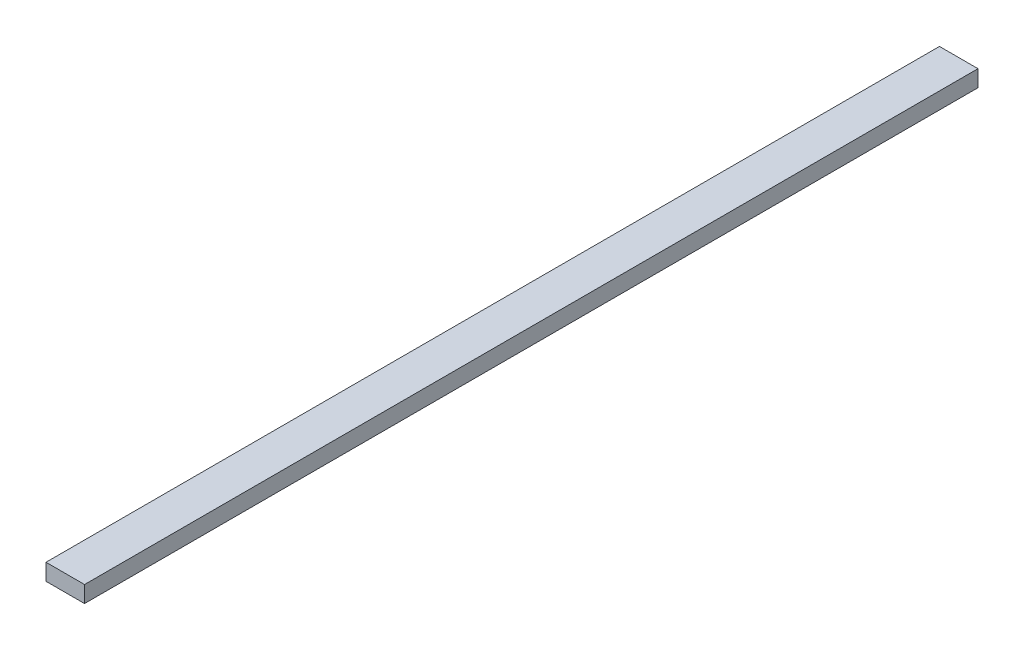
ISO-10303-21;
HEADER;
FILE_DESCRIPTION(('STEP AP214'),'2;1');
FILE_NAME('part.step','',(''),(''),'','','');
FILE_SCHEMA(('AUTOMOTIVE_DESIGN { 1 0 10303 214 1 1 1 1 }'));
ENDSEC;
DATA;
#1=APPLICATION_CONTEXT('core data for automotive mechanical design processes');
#2=APPLICATION_PROTOCOL_DEFINITION('international standard','automotive_design',2000,#1);
#3=PRODUCT_CONTEXT('',#1,'mechanical');
#4=PRODUCT('Part','Part','',(#3));
#5=PRODUCT_RELATED_PRODUCT_CATEGORY('part','',(#4));
#6=PRODUCT_DEFINITION_FORMATION('','',#4);
#7=PRODUCT_DEFINITION_CONTEXT('part definition',#1,'design');
#8=PRODUCT_DEFINITION('design','',#6,#7);
#9=PRODUCT_DEFINITION_SHAPE('','',#8);
#10=(LENGTH_UNIT() NAMED_UNIT(*) SI_UNIT(.MILLI.,.METRE.));
#11=(NAMED_UNIT(*) PLANE_ANGLE_UNIT() SI_UNIT($,.RADIAN.));
#12=(NAMED_UNIT(*) SI_UNIT($,.STERADIAN.) SOLID_ANGLE_UNIT());
#13=UNCERTAINTY_MEASURE_WITH_UNIT(LENGTH_MEASURE(1.E-05),#10,'distance_accuracy_value','');
#14=(GEOMETRIC_REPRESENTATION_CONTEXT(3) GLOBAL_UNCERTAINTY_ASSIGNED_CONTEXT((#13)) GLOBAL_UNIT_ASSIGNED_CONTEXT((#10,
#11,#12)) REPRESENTATION_CONTEXT('',''));
#15=CARTESIAN_POINT('',(0.,0.,0.));
#16=DIRECTION('',(0.,0.,1.));
#17=DIRECTION('',(1.,0.,0.));
#18=AXIS2_PLACEMENT_3D('',#15,#16,#17);
#19=CARTESIAN_POINT('',(-88.9,38.1,0.));
#20=DIRECTION('',(0.,0.,1.));
#21=DIRECTION('',(1.,0.,0.));
#22=AXIS2_PLACEMENT_3D('',#19,#20,#21);
#23=PLANE('',#22);
#24=DIRECTION('',(-1.,0.,0.));
#25=VECTOR('',#24,1.);
#26=CARTESIAN_POINT('',(-88.9,0.,0.));
#27=LINE('',#26,#25);
#28=CARTESIAN_POINT('',(0.,0.,0.));
#29=VERTEX_POINT('',#28);
#30=CARTESIAN_POINT('',(-88.9,0.,0.));
#31=VERTEX_POINT('',#30);
#32=EDGE_CURVE('E96',#29,#31,#27,.T.);
#33=ORIENTED_EDGE('',*,*,#32,.T.);
#34=DIRECTION('',(0.,-1.,0.));
#35=VECTOR('',#34,1.);
#36=CARTESIAN_POINT('',(-88.9,38.1,0.));
#37=LINE('',#36,#35);
#38=CARTESIAN_POINT('',(-88.9,38.1,0.));
#39=VERTEX_POINT('',#38);
#40=EDGE_CURVE('E11',#39,#31,#37,.T.);
#41=ORIENTED_EDGE('',*,*,#40,.F.);
#42=DIRECTION('',(-1.,0.,0.));
#43=VECTOR('',#42,1.);
#44=CARTESIAN_POINT('',(-88.9,38.1,0.));
#45=LINE('',#44,#43);
#46=CARTESIAN_POINT('',(0.,38.1,0.));
#47=VERTEX_POINT('',#46);
#48=EDGE_CURVE('E84',#47,#39,#45,.T.);
#49=ORIENTED_EDGE('',*,*,#48,.F.);
#50=DIRECTION('',(0.,-1.,0.));
#51=VECTOR('',#50,1.);
#52=CARTESIAN_POINT('',(0.,38.1,0.));
#53=LINE('',#52,#51);
#54=EDGE_CURVE('E92',#47,#29,#53,.T.);
#55=ORIENTED_EDGE('',*,*,#54,.T.);
#56=EDGE_LOOP('',(#33,#41,#49,#55));
#57=FACE_BOUND('',#56,.T.);
#58=ADVANCED_FACE('F33',(#57),#23,.F.);
#59=CARTESIAN_POINT('',(-88.9,38.1,2060.575));
#60=DIRECTION('',(1.,0.,0.));
#61=DIRECTION('',(0.,0.,-1.));
#62=AXIS2_PLACEMENT_3D('',#59,#60,#61);
#63=PLANE('',#62);
#64=DIRECTION('',(0.,0.,1.));
#65=VECTOR('',#64,1.);
#66=CARTESIAN_POINT('',(-88.9,0.,2060.575));
#67=LINE('',#66,#65);
#68=CARTESIAN_POINT('',(-88.9,0.,2060.575));
#69=VERTEX_POINT('',#68);
#70=EDGE_CURVE('E88',#31,#69,#67,.T.);
#71=ORIENTED_EDGE('',*,*,#70,.T.);
#72=DIRECTION('',(0.,-1.,0.));
#73=VECTOR('',#72,1.);
#74=CARTESIAN_POINT('',(-88.9,38.1,2060.575));
#75=LINE('',#74,#73);
#76=CARTESIAN_POINT('',(-88.9,38.1,2060.575));
#77=VERTEX_POINT('',#76);
#78=EDGE_CURVE('E41',#77,#69,#75,.T.);
#79=ORIENTED_EDGE('',*,*,#78,.F.);
#80=DIRECTION('',(0.,0.,1.));
#81=VECTOR('',#80,1.);
#82=CARTESIAN_POINT('',(-88.9,38.1,2060.575));
#83=LINE('',#82,#81);
#84=EDGE_CURVE('E79',#39,#77,#83,.T.);
#85=ORIENTED_EDGE('',*,*,#84,.F.);
#86=ORIENTED_EDGE('',*,*,#40,.T.);
#87=EDGE_LOOP('',(#71,#79,#85,#86));
#88=FACE_BOUND('',#87,.T.);
#89=ADVANCED_FACE('F87',(#88),#63,.F.);
#90=CARTESIAN_POINT('',(2.52347657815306E-13,38.1,2060.575));
#91=DIRECTION('',(0.,0.,-1.));
#92=DIRECTION('',(-1.,0.,0.));
#93=AXIS2_PLACEMENT_3D('',#90,#91,#92);
#94=PLANE('',#93);
#95=DIRECTION('',(1.,0.,0.));
#96=VECTOR('',#95,1.);
#97=CARTESIAN_POINT('',(2.52347657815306E-13,0.,2060.575));
#98=LINE('',#97,#96);
#99=CARTESIAN_POINT('',(2.52347657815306E-13,0.,2060.575));
#100=VERTEX_POINT('',#99);
#101=EDGE_CURVE('E66',#69,#100,#98,.T.);
#102=ORIENTED_EDGE('',*,*,#101,.T.);
#103=DIRECTION('',(0.,-1.,0.));
#104=VECTOR('',#103,1.);
#105=CARTESIAN_POINT('',(2.52347657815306E-13,38.1,2060.575));
#106=LINE('',#105,#104);
#107=CARTESIAN_POINT('',(2.52347657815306E-13,38.1,2060.575));
#108=VERTEX_POINT('',#107);
#109=EDGE_CURVE('E89',#108,#100,#106,.T.);
#110=ORIENTED_EDGE('',*,*,#109,.F.);
#111=DIRECTION('',(1.,0.,0.));
#112=VECTOR('',#111,1.);
#113=CARTESIAN_POINT('',(2.52347657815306E-13,38.1,2060.575));
#114=LINE('',#113,#112);
#115=EDGE_CURVE('E82',#77,#108,#114,.T.);
#116=ORIENTED_EDGE('',*,*,#115,.F.);
#117=ORIENTED_EDGE('',*,*,#78,.T.);
#118=EDGE_LOOP('',(#102,#110,#116,#117));
#119=FACE_BOUND('',#118,.T.);
#120=ADVANCED_FACE('F90',(#119),#94,.F.);
#121=CARTESIAN_POINT('',(0.,38.1,0.));
#122=DIRECTION('',(-1.,0.,0.));
#123=DIRECTION('',(0.,0.,1.));
#124=AXIS2_PLACEMENT_3D('',#121,#122,#123);
#125=PLANE('',#124);
#126=DIRECTION('',(0.,0.,-1.));
#127=VECTOR('',#126,1.);
#128=CARTESIAN_POINT('',(0.,0.,0.));
#129=LINE('',#128,#127);
#130=EDGE_CURVE('E72',#100,#29,#129,.T.);
#131=ORIENTED_EDGE('',*,*,#130,.T.);
#132=ORIENTED_EDGE('',*,*,#54,.F.);
#133=DIRECTION('',(0.,0.,-1.));
#134=VECTOR('',#133,1.);
#135=CARTESIAN_POINT('',(0.,38.1,0.));
#136=LINE('',#135,#134);
#137=EDGE_CURVE('E49',#108,#47,#136,.T.);
#138=ORIENTED_EDGE('',*,*,#137,.F.);
#139=ORIENTED_EDGE('',*,*,#109,.T.);
#140=EDGE_LOOP('',(#131,#132,#138,#139));
#141=FACE_BOUND('',#140,.T.);
#142=ADVANCED_FACE('F103',(#141),#125,.F.);
#143=CARTESIAN_POINT('',(0.,38.1,0.));
#144=DIRECTION('',(0.,-1.,0.));
#145=DIRECTION('',(0.,0.,-1.));
#146=AXIS2_PLACEMENT_3D('',#143,#144,#145);
#147=PLANE('',#146);
#148=ORIENTED_EDGE('',*,*,#48,.T.);
#149=ORIENTED_EDGE('',*,*,#84,.T.);
#150=ORIENTED_EDGE('',*,*,#115,.T.);
#151=ORIENTED_EDGE('',*,*,#137,.T.);
#152=EDGE_LOOP('',(#148,#149,#150,#151));
#153=FACE_BOUND('',#152,.T.);
#154=ADVANCED_FACE('F80',(#153),#147,.F.);
#155=CARTESIAN_POINT('',(0.,0.,0.));
#156=DIRECTION('',(0.,-1.,0.));
#157=DIRECTION('',(0.,0.,-1.));
#158=AXIS2_PLACEMENT_3D('',#155,#156,#157);
#159=PLANE('',#158);
#160=ORIENTED_EDGE('',*,*,#32,.F.);
#161=ORIENTED_EDGE('',*,*,#130,.F.);
#162=ORIENTED_EDGE('',*,*,#101,.F.);
#163=ORIENTED_EDGE('',*,*,#70,.F.);
#164=EDGE_LOOP('',(#160,#161,#162,#163));
#165=FACE_BOUND('',#164,.T.);
#166=ADVANCED_FACE('F106',(#165),#159,.T.);
#167=CLOSED_SHELL('',(#58,#89,#120,#142,#154,#166));
#168=MANIFOLD_SOLID_BREP('B2',#167);
#169=ADVANCED_BREP_SHAPE_REPRESENTATION('',(#18,#168),#14);
#170=SHAPE_DEFINITION_REPRESENTATION(#9,#169);
ENDSEC;
END-ISO-10303-21;
